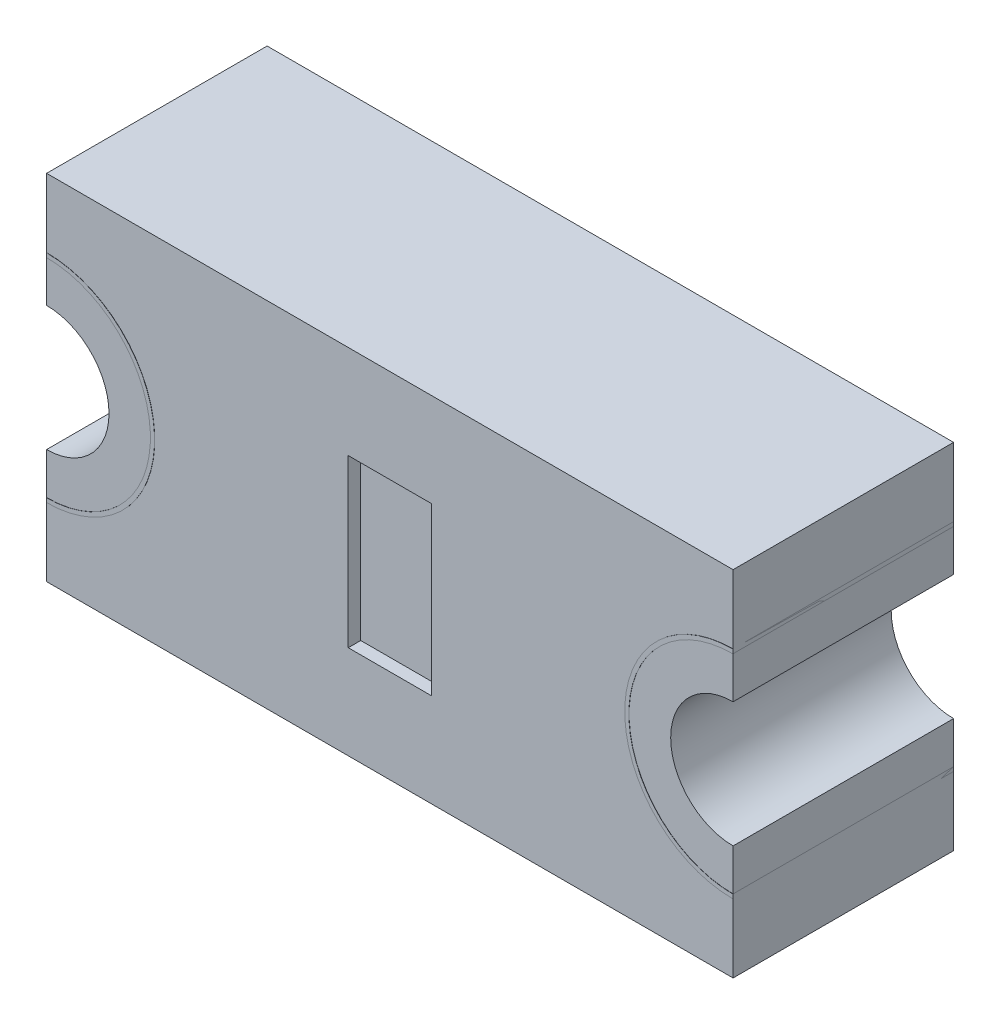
ISO-10303-21;
HEADER;
FILE_DESCRIPTION(('STEP AP214'),'2;1');
FILE_NAME('part.step','',(''),(''),'','','');
FILE_SCHEMA(('AUTOMOTIVE_DESIGN { 1 0 10303 214 1 1 1 1 }'));
ENDSEC;
DATA;
#1=APPLICATION_CONTEXT('core data for automotive mechanical design processes');
#2=APPLICATION_PROTOCOL_DEFINITION('international standard','automotive_design',2000,#1);
#3=PRODUCT_CONTEXT('',#1,'mechanical');
#4=PRODUCT('Part','Part','',(#3));
#5=PRODUCT_RELATED_PRODUCT_CATEGORY('part','',(#4));
#6=PRODUCT_DEFINITION_FORMATION('','',#4);
#7=PRODUCT_DEFINITION_CONTEXT('part definition',#1,'design');
#8=PRODUCT_DEFINITION('design','',#6,#7);
#9=PRODUCT_DEFINITION_SHAPE('','',#8);
#10=(LENGTH_UNIT() NAMED_UNIT(*) SI_UNIT(.MILLI.,.METRE.));
#11=(NAMED_UNIT(*) PLANE_ANGLE_UNIT() SI_UNIT($,.RADIAN.));
#12=(NAMED_UNIT(*) SI_UNIT($,.STERADIAN.) SOLID_ANGLE_UNIT());
#13=UNCERTAINTY_MEASURE_WITH_UNIT(LENGTH_MEASURE(1.E-05),#10,'distance_accuracy_value','');
#14=(GEOMETRIC_REPRESENTATION_CONTEXT(3) GLOBAL_UNCERTAINTY_ASSIGNED_CONTEXT((#13)) GLOBAL_UNIT_ASSIGNED_CONTEXT((#10,
#11,#12)) REPRESENTATION_CONTEXT('',''));
#15=CARTESIAN_POINT('',(0.,0.,0.));
#16=DIRECTION('',(0.,0.,1.));
#17=DIRECTION('',(1.,0.,0.));
#18=AXIS2_PLACEMENT_3D('',#15,#16,#17);
#19=CARTESIAN_POINT('',(-0.825,0.,1.5));
#20=DIRECTION('',(0.,0.,-1.));
#21=DIRECTION('',(-1.,0.,0.));
#22=AXIS2_PLACEMENT_3D('',#19,#20,#21);
#23=CYLINDRICAL_SURFACE('',#22,0.25);
#24=CARTESIAN_POINT('',(-0.825,0.,0.));
#25=DIRECTION('',(0.,0.,-1.));
#26=DIRECTION('',(1.,0.,0.));
#27=AXIS2_PLACEMENT_3D('',#24,#25,#26);
#28=CIRCLE('',#27,0.25);
#29=CARTESIAN_POINT('',(-0.825,0.25,0.));
#30=VERTEX_POINT('',#29);
#31=CARTESIAN_POINT('',(-0.825,-0.25,0.));
#32=VERTEX_POINT('',#31);
#33=EDGE_CURVE('P0_E256',#30,#32,#28,.T.);
#34=ORIENTED_EDGE('',*,*,#33,.T.);
#35=DIRECTION('',(0.,0.,1.));
#36=VECTOR('',#35,1.);
#37=CARTESIAN_POINT('',(-0.825,-0.25,1.5));
#38=LINE('',#37,#36);
#39=CARTESIAN_POINT('',(-0.825,-0.25,0.53));
#40=VERTEX_POINT('',#39);
#41=EDGE_CURVE('P0_E162',#32,#40,#38,.T.);
#42=ORIENTED_EDGE('',*,*,#41,.T.);
#43=CARTESIAN_POINT('',(-0.825,0.,0.53));
#44=DIRECTION('',(0.,0.,1.));
#45=DIRECTION('',(-1.,0.,0.));
#46=AXIS2_PLACEMENT_3D('',#43,#44,#45);
#47=CIRCLE('',#46,0.25);
#48=CARTESIAN_POINT('',(-0.825,0.25,0.53));
#49=VERTEX_POINT('',#48);
#50=EDGE_CURVE('P0_E147',#40,#49,#47,.T.);
#51=ORIENTED_EDGE('',*,*,#50,.T.);
#52=DIRECTION('',(0.,0.,-1.));
#53=VECTOR('',#52,1.);
#54=CARTESIAN_POINT('',(-0.825,0.25,1.5));
#55=LINE('',#54,#53);
#56=EDGE_CURVE('P0_E189',#49,#30,#55,.T.);
#57=ORIENTED_EDGE('',*,*,#56,.T.);
#58=EDGE_LOOP('',(#34,#42,#51,#57));
#59=FACE_BOUND('',#58,.T.);
#60=ADVANCED_FACE('P0_F17',(#59),#23,.F.);
#61=CARTESIAN_POINT('',(-0.825,0.425,0.5));
#62=DIRECTION('',(0.,-1.,0.));
#63=DIRECTION('',(0.,0.,-1.));
#64=AXIS2_PLACEMENT_3D('',#61,#62,#63);
#65=PLANE('',#64);
#66=DIRECTION('',(-1.,0.,0.));
#67=VECTOR('',#66,1.);
#68=CARTESIAN_POINT('',(-0.825,0.425,0.));
#69=LINE('',#68,#67);
#70=CARTESIAN_POINT('',(0.825,0.425,0.));
#71=VERTEX_POINT('',#70);
#72=CARTESIAN_POINT('',(-0.825,0.425,0.));
#73=VERTEX_POINT('',#72);
#74=EDGE_CURVE('P0_E226',#71,#73,#69,.T.);
#75=ORIENTED_EDGE('',*,*,#74,.T.);
#76=DIRECTION('',(0.,0.,-1.));
#77=VECTOR('',#76,1.);
#78=CARTESIAN_POINT('',(-0.825,0.425,0.5));
#79=LINE('',#78,#77);
#80=CARTESIAN_POINT('',(-0.825,0.425,0.53));
#81=VERTEX_POINT('',#80);
#82=EDGE_CURVE('P0_E184',#81,#73,#79,.T.);
#83=ORIENTED_EDGE('',*,*,#82,.F.);
#84=DIRECTION('',(-1.,0.,0.));
#85=VECTOR('',#84,1.);
#86=CARTESIAN_POINT('',(0.825,0.425,0.53));
#87=LINE('',#86,#85);
#88=CARTESIAN_POINT('',(0.825,0.425,0.53));
#89=VERTEX_POINT('',#88);
#90=EDGE_CURVE('P0_E194',#89,#81,#87,.T.);
#91=ORIENTED_EDGE('',*,*,#90,.F.);
#92=DIRECTION('',(0.,0.,-1.));
#93=VECTOR('',#92,1.);
#94=CARTESIAN_POINT('',(0.825,0.425,0.5));
#95=LINE('',#94,#93);
#96=EDGE_CURVE('P0_E11',#89,#71,#95,.T.);
#97=ORIENTED_EDGE('',*,*,#96,.T.);
#98=EDGE_LOOP('',(#75,#83,#91,#97));
#99=FACE_BOUND('',#98,.T.);
#100=ADVANCED_FACE('P0_F445',(#99),#65,.F.);
#101=CARTESIAN_POINT('',(0.825,0.425,0.5));
#102=DIRECTION('',(-1.,0.,0.));
#103=DIRECTION('',(0.,1.,0.));
#104=AXIS2_PLACEMENT_3D('',#101,#102,#103);
#105=PLANE('',#104);
#106=DIRECTION('',(0.,1.,0.));
#107=VECTOR('',#106,1.);
#108=CARTESIAN_POINT('',(0.825,0.425,0.53));
#109=LINE('',#108,#107);
#110=CARTESIAN_POINT('',(0.825,0.25,0.53));
#111=VERTEX_POINT('',#110);
#112=EDGE_CURVE('P0_E190',#111,#89,#109,.T.);
#113=ORIENTED_EDGE('',*,*,#112,.F.);
#114=DIRECTION('',(0.,0.,-1.));
#115=VECTOR('',#114,1.);
#116=CARTESIAN_POINT('',(0.825,0.25,1.5));
#117=LINE('',#116,#115);
#118=CARTESIAN_POINT('',(0.825,0.25,0.));
#119=VERTEX_POINT('',#118);
#120=EDGE_CURVE('P0_E25',#111,#119,#117,.T.);
#121=ORIENTED_EDGE('',*,*,#120,.T.);
#122=DIRECTION('',(0.,1.,0.));
#123=VECTOR('',#122,1.);
#124=CARTESIAN_POINT('',(0.825,0.425,0.));
#125=LINE('',#124,#123);
#126=EDGE_CURVE('P0_E222',#119,#71,#125,.T.);
#127=ORIENTED_EDGE('',*,*,#126,.T.);
#128=ORIENTED_EDGE('',*,*,#96,.F.);
#129=EDGE_LOOP('',(#113,#121,#127,#128));
#130=FACE_BOUND('',#129,.T.);
#131=ADVANCED_FACE('P0_F441',(#130),#105,.F.);
#132=CARTESIAN_POINT('',(0.825,0.,1.5));
#133=DIRECTION('',(0.,0.,-1.));
#134=DIRECTION('',(1.,0.,0.));
#135=AXIS2_PLACEMENT_3D('',#132,#133,#134);
#136=CYLINDRICAL_SURFACE('',#135,0.25);
#137=ORIENTED_EDGE('',*,*,#120,.F.);
#138=CARTESIAN_POINT('',(0.825,0.,0.53));
#139=DIRECTION('',(0.,0.,-1.));
#140=DIRECTION('',(-1.,0.,0.));
#141=AXIS2_PLACEMENT_3D('',#138,#139,#140);
#142=CIRCLE('',#141,0.25);
#143=CARTESIAN_POINT('',(0.825,-0.25,0.53));
#144=VERTEX_POINT('',#143);
#145=EDGE_CURVE('P0_E183',#144,#111,#142,.T.);
#146=ORIENTED_EDGE('',*,*,#145,.F.);
#147=DIRECTION('',(0.,0.,1.));
#148=VECTOR('',#147,1.);
#149=CARTESIAN_POINT('',(0.825,-0.25,1.5));
#150=LINE('',#149,#148);
#151=CARTESIAN_POINT('',(0.825,-0.25,0.));
#152=VERTEX_POINT('',#151);
#153=EDGE_CURVE('P0_E38',#152,#144,#150,.T.);
#154=ORIENTED_EDGE('',*,*,#153,.F.);
#155=CARTESIAN_POINT('',(0.825,0.,0.));
#156=DIRECTION('',(0.,0.,1.));
#157=DIRECTION('',(1.,0.,0.));
#158=AXIS2_PLACEMENT_3D('',#155,#156,#157);
#159=CIRCLE('',#158,0.25);
#160=EDGE_CURVE('P0_E225',#119,#152,#159,.T.);
#161=ORIENTED_EDGE('',*,*,#160,.F.);
#162=EDGE_LOOP('',(#137,#146,#154,#161));
#163=FACE_BOUND('',#162,.T.);
#164=ADVANCED_FACE('P0_F440',(#163),#136,.F.);
#165=CARTESIAN_POINT('',(0.825,0.425,0.5));
#166=DIRECTION('',(-1.,0.,0.));
#167=DIRECTION('',(0.,1.,0.));
#168=AXIS2_PLACEMENT_3D('',#165,#166,#167);
#169=PLANE('',#168);
#170=DIRECTION('',(0.,1.,0.));
#171=VECTOR('',#170,1.);
#172=CARTESIAN_POINT('',(0.825,0.425,0.));
#173=LINE('',#172,#171);
#174=CARTESIAN_POINT('',(0.825,-0.425,0.));
#175=VERTEX_POINT('',#174);
#176=EDGE_CURVE('P0_E264',#175,#152,#173,.T.);
#177=ORIENTED_EDGE('',*,*,#176,.T.);
#178=ORIENTED_EDGE('',*,*,#153,.T.);
#179=DIRECTION('',(0.,1.,0.));
#180=VECTOR('',#179,1.);
#181=CARTESIAN_POINT('',(0.825,0.425,0.53));
#182=LINE('',#181,#180);
#183=CARTESIAN_POINT('',(0.825,-0.425,0.53));
#184=VERTEX_POINT('',#183);
#185=EDGE_CURVE('P0_E180',#184,#144,#182,.T.);
#186=ORIENTED_EDGE('',*,*,#185,.F.);
#187=DIRECTION('',(0.,0.,-1.));
#188=VECTOR('',#187,1.);
#189=CARTESIAN_POINT('',(0.825,-0.425,0.5));
#190=LINE('',#189,#188);
#191=EDGE_CURVE('P0_E166',#184,#175,#190,.T.);
#192=ORIENTED_EDGE('',*,*,#191,.T.);
#193=EDGE_LOOP('',(#177,#178,#186,#192));
#194=FACE_BOUND('',#193,.T.);
#195=ADVANCED_FACE('P0_F439',(#194),#169,.F.);
#196=CARTESIAN_POINT('',(-0.825,-0.425,0.));
#197=DIRECTION('',(0.,0.,1.));
#198=DIRECTION('',(1.,0.,0.));
#199=AXIS2_PLACEMENT_3D('',#196,#197,#198);
#200=PLANE('',#199);
#201=ORIENTED_EDGE('',*,*,#33,.F.);
#202=DIRECTION('',(0.,-1.,0.));
#203=VECTOR('',#202,1.);
#204=CARTESIAN_POINT('',(-0.825,0.425,0.));
#205=LINE('',#204,#203);
#206=EDGE_CURVE('P0_E188',#73,#30,#205,.T.);
#207=ORIENTED_EDGE('',*,*,#206,.F.);
#208=ORIENTED_EDGE('',*,*,#74,.F.);
#209=ORIENTED_EDGE('',*,*,#126,.F.);
#210=ORIENTED_EDGE('',*,*,#160,.T.);
#211=ORIENTED_EDGE('',*,*,#176,.F.);
#212=DIRECTION('',(1.,0.,0.));
#213=VECTOR('',#212,1.);
#214=CARTESIAN_POINT('',(-0.825,-0.425,0.));
#215=LINE('',#214,#213);
#216=CARTESIAN_POINT('',(-0.825,-0.425,0.));
#217=VERTEX_POINT('',#216);
#218=EDGE_CURVE('P0_E173',#217,#175,#215,.T.);
#219=ORIENTED_EDGE('',*,*,#218,.F.);
#220=DIRECTION('',(0.,-1.,0.));
#221=VECTOR('',#220,1.);
#222=CARTESIAN_POINT('',(-0.825,0.425,0.));
#223=LINE('',#222,#221);
#224=EDGE_CURVE('P0_E152',#32,#217,#223,.T.);
#225=ORIENTED_EDGE('',*,*,#224,.F.);
#226=EDGE_LOOP('',(#201,#207,#208,#209,#210,#211,#219,#225));
#227=FACE_BOUND('',#226,.T.);
#228=ADVANCED_FACE('P0_F436',(#227),#200,.F.);
#229=CARTESIAN_POINT('',(-0.825,0.425,0.5));
#230=DIRECTION('',(1.,0.,0.));
#231=DIRECTION('',(0.,1.,0.));
#232=AXIS2_PLACEMENT_3D('',#229,#230,#231);
#233=PLANE('',#232);
#234=ORIENTED_EDGE('',*,*,#56,.F.);
#235=DIRECTION('',(0.,-1.,0.));
#236=VECTOR('',#235,1.);
#237=CARTESIAN_POINT('',(-0.825,0.425,0.53));
#238=LINE('',#237,#236);
#239=EDGE_CURVE('P0_E198',#81,#49,#238,.T.);
#240=ORIENTED_EDGE('',*,*,#239,.F.);
#241=ORIENTED_EDGE('',*,*,#82,.T.);
#242=ORIENTED_EDGE('',*,*,#206,.T.);
#243=EDGE_LOOP('',(#234,#240,#241,#242));
#244=FACE_BOUND('',#243,.T.);
#245=ADVANCED_FACE('P0_F450',(#244),#233,.F.);
#246=CARTESIAN_POINT('',(-0.825,-0.425,0.5));
#247=DIRECTION('',(0.,0.,1.));
#248=DIRECTION('',(1.,0.,0.));
#249=AXIS2_PLACEMENT_3D('',#246,#247,#248);
#250=PLANE('',#249);
#251=DIRECTION('',(0.,-1.,0.));
#252=VECTOR('',#251,1.);
#253=CARTESIAN_POINT('',(-0.1,0.2,0.5));
#254=LINE('',#253,#252);
#255=CARTESIAN_POINT('',(-0.1,0.2,0.5));
#256=VERTEX_POINT('',#255);
#257=CARTESIAN_POINT('',(-0.1,-0.2,0.5));
#258=VERTEX_POINT('',#257);
#259=EDGE_CURVE('P0_E250',#256,#258,#254,.T.);
#260=ORIENTED_EDGE('',*,*,#259,.T.);
#261=DIRECTION('',(1.,0.,0.));
#262=VECTOR('',#261,1.);
#263=CARTESIAN_POINT('',(-0.1,-0.2,0.5));
#264=LINE('',#263,#262);
#265=CARTESIAN_POINT('',(0.1,-0.2,0.5));
#266=VERTEX_POINT('',#265);
#267=EDGE_CURVE('P0_E217',#258,#266,#264,.T.);
#268=ORIENTED_EDGE('',*,*,#267,.T.);
#269=DIRECTION('',(0.,1.,0.));
#270=VECTOR('',#269,1.);
#271=CARTESIAN_POINT('',(0.1,0.2,0.5));
#272=LINE('',#271,#270);
#273=CARTESIAN_POINT('',(0.1,0.2,0.5));
#274=VERTEX_POINT('',#273);
#275=EDGE_CURVE('P0_E234',#266,#274,#272,.T.);
#276=ORIENTED_EDGE('',*,*,#275,.T.);
#277=DIRECTION('',(-1.,0.,0.));
#278=VECTOR('',#277,1.);
#279=CARTESIAN_POINT('',(-0.1,0.2,0.5));
#280=LINE('',#279,#278);
#281=EDGE_CURVE('P0_E242',#274,#256,#280,.T.);
#282=ORIENTED_EDGE('',*,*,#281,.T.);
#283=EDGE_LOOP('',(#260,#268,#276,#282));
#284=FACE_BOUND('',#283,.T.);
#285=ADVANCED_FACE('P0_F452',(#284),#250,.T.);
#286=CARTESIAN_POINT('',(-0.1,0.2,0.53));
#287=DIRECTION('',(1.,0.,0.));
#288=DIRECTION('',(0.,1.,0.));
#289=AXIS2_PLACEMENT_3D('',#286,#287,#288);
#290=PLANE('',#289);
#291=ORIENTED_EDGE('',*,*,#259,.F.);
#292=DIRECTION('',(0.,0.,-1.));
#293=VECTOR('',#292,1.);
#294=CARTESIAN_POINT('',(-0.1,0.2,0.53));
#295=LINE('',#294,#293);
#296=CARTESIAN_POINT('',(-0.1,0.2,0.53));
#297=VERTEX_POINT('',#296);
#298=EDGE_CURVE('P0_E246',#297,#256,#295,.T.);
#299=ORIENTED_EDGE('',*,*,#298,.F.);
#300=DIRECTION('',(0.,-1.,0.));
#301=VECTOR('',#300,1.);
#302=CARTESIAN_POINT('',(-0.1,0.2,0.53));
#303=LINE('',#302,#301);
#304=CARTESIAN_POINT('',(-0.1,-0.2,0.53));
#305=VERTEX_POINT('',#304);
#306=EDGE_CURVE('P0_E201',#297,#305,#303,.T.);
#307=ORIENTED_EDGE('',*,*,#306,.T.);
#308=DIRECTION('',(0.,0.,-1.));
#309=VECTOR('',#308,1.);
#310=CARTESIAN_POINT('',(-0.1,-0.2,0.53));
#311=LINE('',#310,#309);
#312=EDGE_CURVE('P0_E221',#305,#258,#311,.T.);
#313=ORIENTED_EDGE('',*,*,#312,.T.);
#314=EDGE_LOOP('',(#291,#299,#307,#313));
#315=FACE_BOUND('',#314,.T.);
#316=ADVANCED_FACE('P0_F459',(#315),#290,.T.);
#317=CARTESIAN_POINT('',(-0.1,0.2,0.53));
#318=DIRECTION('',(0.,-1.,0.));
#319=DIRECTION('',(0.,0.,-1.));
#320=AXIS2_PLACEMENT_3D('',#317,#318,#319);
#321=PLANE('',#320);
#322=ORIENTED_EDGE('',*,*,#281,.F.);
#323=DIRECTION('',(0.,0.,-1.));
#324=VECTOR('',#323,1.);
#325=CARTESIAN_POINT('',(0.1,0.2,0.53));
#326=LINE('',#325,#324);
#327=CARTESIAN_POINT('',(0.1,0.2,0.53));
#328=VERTEX_POINT('',#327);
#329=EDGE_CURVE('P0_E238',#328,#274,#326,.T.);
#330=ORIENTED_EDGE('',*,*,#329,.F.);
#331=DIRECTION('',(-1.,0.,0.));
#332=VECTOR('',#331,1.);
#333=CARTESIAN_POINT('',(-0.1,0.2,0.53));
#334=LINE('',#333,#332);
#335=EDGE_CURVE('P0_E205',#328,#297,#334,.T.);
#336=ORIENTED_EDGE('',*,*,#335,.T.);
#337=ORIENTED_EDGE('',*,*,#298,.T.);
#338=EDGE_LOOP('',(#322,#330,#336,#337));
#339=FACE_BOUND('',#338,.T.);
#340=ADVANCED_FACE('P0_F487',(#339),#321,.T.);
#341=CARTESIAN_POINT('',(0.1,0.2,0.53));
#342=DIRECTION('',(-1.,0.,0.));
#343=DIRECTION('',(0.,0.,1.));
#344=AXIS2_PLACEMENT_3D('',#341,#342,#343);
#345=PLANE('',#344);
#346=ORIENTED_EDGE('',*,*,#275,.F.);
#347=DIRECTION('',(0.,0.,-1.));
#348=VECTOR('',#347,1.);
#349=CARTESIAN_POINT('',(0.1,-0.2,0.53));
#350=LINE('',#349,#348);
#351=CARTESIAN_POINT('',(0.1,-0.2,0.53));
#352=VERTEX_POINT('',#351);
#353=EDGE_CURVE('P0_E230',#352,#266,#350,.T.);
#354=ORIENTED_EDGE('',*,*,#353,.F.);
#355=DIRECTION('',(0.,1.,0.));
#356=VECTOR('',#355,1.);
#357=CARTESIAN_POINT('',(0.1,0.2,0.53));
#358=LINE('',#357,#356);
#359=EDGE_CURVE('P0_E209',#352,#328,#358,.T.);
#360=ORIENTED_EDGE('',*,*,#359,.T.);
#361=ORIENTED_EDGE('',*,*,#329,.T.);
#362=EDGE_LOOP('',(#346,#354,#360,#361));
#363=FACE_BOUND('',#362,.T.);
#364=ADVANCED_FACE('P0_F489',(#363),#345,.T.);
#365=CARTESIAN_POINT('',(-0.1,-0.2,0.53));
#366=DIRECTION('',(0.,1.,0.));
#367=DIRECTION('',(1.,0.,0.));
#368=AXIS2_PLACEMENT_3D('',#365,#366,#367);
#369=PLANE('',#368);
#370=ORIENTED_EDGE('',*,*,#267,.F.);
#371=ORIENTED_EDGE('',*,*,#312,.F.);
#372=DIRECTION('',(1.,0.,0.));
#373=VECTOR('',#372,1.);
#374=CARTESIAN_POINT('',(-0.1,-0.2,0.53));
#375=LINE('',#374,#373);
#376=EDGE_CURVE('P0_E213',#305,#352,#375,.T.);
#377=ORIENTED_EDGE('',*,*,#376,.T.);
#378=ORIENTED_EDGE('',*,*,#353,.T.);
#379=EDGE_LOOP('',(#370,#371,#377,#378));
#380=FACE_BOUND('',#379,.T.);
#381=ADVANCED_FACE('P0_F483',(#380),#369,.T.);
#382=CARTESIAN_POINT('',(0.825,0.425,0.53));
#383=DIRECTION('',(0.,0.,-1.));
#384=DIRECTION('',(0.,-1.,0.));
#385=AXIS2_PLACEMENT_3D('',#382,#383,#384);
#386=PLANE('',#385);
#387=ORIENTED_EDGE('',*,*,#306,.F.);
#388=ORIENTED_EDGE('',*,*,#335,.F.);
#389=ORIENTED_EDGE('',*,*,#359,.F.);
#390=ORIENTED_EDGE('',*,*,#376,.F.);
#391=EDGE_LOOP('',(#387,#388,#389,#390));
#392=FACE_BOUND('',#391,.T.);
#393=ORIENTED_EDGE('',*,*,#50,.F.);
#394=DIRECTION('',(0.,-1.,0.));
#395=VECTOR('',#394,1.);
#396=CARTESIAN_POINT('',(-0.825,0.425,0.53));
#397=LINE('',#396,#395);
#398=CARTESIAN_POINT('',(-0.825,-0.425,0.53));
#399=VERTEX_POINT('',#398);
#400=EDGE_CURVE('P0_E138',#40,#399,#397,.T.);
#401=ORIENTED_EDGE('',*,*,#400,.T.);
#402=DIRECTION('',(1.,0.,0.));
#403=VECTOR('',#402,1.);
#404=CARTESIAN_POINT('',(0.825,-0.425,0.53));
#405=LINE('',#404,#403);
#406=EDGE_CURVE('P0_E143',#399,#184,#405,.T.);
#407=ORIENTED_EDGE('',*,*,#406,.T.);
#408=ORIENTED_EDGE('',*,*,#185,.T.);
#409=ORIENTED_EDGE('',*,*,#145,.T.);
#410=ORIENTED_EDGE('',*,*,#112,.T.);
#411=ORIENTED_EDGE('',*,*,#90,.T.);
#412=ORIENTED_EDGE('',*,*,#239,.T.);
#413=EDGE_LOOP('',(#393,#401,#407,#408,#409,#410,#411,#412));
#414=FACE_BOUND('',#413,.T.);
#415=ADVANCED_FACE('P0_F140',(#392,#414),#386,.F.);
#416=CARTESIAN_POINT('',(-0.825,0.425,0.5));
#417=DIRECTION('',(1.,0.,0.));
#418=DIRECTION('',(0.,1.,0.));
#419=AXIS2_PLACEMENT_3D('',#416,#417,#418);
#420=PLANE('',#419);
#421=ORIENTED_EDGE('',*,*,#41,.F.);
#422=ORIENTED_EDGE('',*,*,#224,.T.);
#423=DIRECTION('',(0.,0.,-1.));
#424=VECTOR('',#423,1.);
#425=CARTESIAN_POINT('',(-0.825,-0.425,0.5));
#426=LINE('',#425,#424);
#427=EDGE_CURVE('P0_E155',#399,#217,#426,.T.);
#428=ORIENTED_EDGE('',*,*,#427,.F.);
#429=ORIENTED_EDGE('',*,*,#400,.F.);
#430=EDGE_LOOP('',(#421,#422,#428,#429));
#431=FACE_BOUND('',#430,.T.);
#432=ADVANCED_FACE('P0_F156',(#431),#420,.F.);
#433=CARTESIAN_POINT('',(-0.825,-0.425,0.5));
#434=DIRECTION('',(0.,1.,0.));
#435=DIRECTION('',(1.,0.,0.));
#436=AXIS2_PLACEMENT_3D('',#433,#434,#435);
#437=PLANE('',#436);
#438=ORIENTED_EDGE('',*,*,#218,.T.);
#439=ORIENTED_EDGE('',*,*,#191,.F.);
#440=ORIENTED_EDGE('',*,*,#406,.F.);
#441=ORIENTED_EDGE('',*,*,#427,.T.);
#442=EDGE_LOOP('',(#438,#439,#440,#441));
#443=FACE_BOUND('',#442,.T.);
#444=ADVANCED_FACE('P0_F164',(#443),#437,.F.);
#445=CLOSED_SHELL('',(#60,#100,#131,#164,#195,#228,#245,#285,#316,#340,#364,#381,#415,#432,#444));
#446=MANIFOLD_SOLID_BREP('P0_B1',#445);
#447=CARTESIAN_POINT('',(0.825,0.,0.53));
#448=DIRECTION('',(0.,0.,1.));
#449=DIRECTION('',(1.,0.,0.));
#450=AXIS2_PLACEMENT_3D('',#447,#448,#449);
#451=PLANE('',#450);
#452=CARTESIAN_POINT('',(0.825,0.,0.53));
#453=DIRECTION('',(0.,0.,1.));
#454=DIRECTION('',(1.,0.,0.));
#455=AXIS2_PLACEMENT_3D('',#452,#453,#454);
#456=CIRCLE('',#455,0.25);
#457=CARTESIAN_POINT('',(0.825,0.25,0.53));
#458=VERTEX_POINT('',#457);
#459=CARTESIAN_POINT('',(0.825,-0.25,0.53));
#460=VERTEX_POINT('',#459);
#461=EDGE_CURVE('P1_E74',#458,#460,#456,.T.);
#462=ORIENTED_EDGE('',*,*,#461,.T.);
#463=DIRECTION('',(0.,1.,0.));
#464=VECTOR('',#463,1.);
#465=CARTESIAN_POINT('',(0.825,-0.15,0.53));
#466=LINE('',#465,#464);
#467=CARTESIAN_POINT('',(0.825,-0.15,0.53));
#468=VERTEX_POINT('',#467);
#469=EDGE_CURVE('P1_E97',#460,#468,#466,.T.);
#470=ORIENTED_EDGE('',*,*,#469,.T.);
#471=CARTESIAN_POINT('',(0.825,0.,0.53));
#472=DIRECTION('',(0.,0.,-1.));
#473=DIRECTION('',(1.,0.,0.));
#474=AXIS2_PLACEMENT_3D('',#471,#472,#473);
#475=CIRCLE('',#474,0.15);
#476=CARTESIAN_POINT('',(0.825,0.15,0.53));
#477=VERTEX_POINT('',#476);
#478=EDGE_CURVE('P1_E75',#468,#477,#475,.T.);
#479=ORIENTED_EDGE('',*,*,#478,.T.);
#480=DIRECTION('',(0.,1.,0.));
#481=VECTOR('',#480,1.);
#482=CARTESIAN_POINT('',(0.825,0.25,0.53));
#483=LINE('',#482,#481);
#484=EDGE_CURVE('P1_E25',#477,#458,#483,.T.);
#485=ORIENTED_EDGE('',*,*,#484,.T.);
#486=EDGE_LOOP('',(#462,#470,#479,#485));
#487=FACE_BOUND('',#486,.T.);
#488=ADVANCED_FACE('P1_F17',(#487),#451,.T.);
#489=CARTESIAN_POINT('',(0.825,0.,0.));
#490=DIRECTION('',(0.,0.,1.));
#491=DIRECTION('',(1.,0.,0.));
#492=AXIS2_PLACEMENT_3D('',#489,#490,#491);
#493=PLANE('',#492);
#494=CARTESIAN_POINT('',(0.825,0.,0.));
#495=DIRECTION('',(0.,0.,1.));
#496=DIRECTION('',(1.,0.,0.));
#497=AXIS2_PLACEMENT_3D('',#494,#495,#496);
#498=CIRCLE('',#497,0.25);
#499=CARTESIAN_POINT('',(0.825,0.25,0.));
#500=VERTEX_POINT('',#499);
#501=CARTESIAN_POINT('',(0.825,-0.25,0.));
#502=VERTEX_POINT('',#501);
#503=EDGE_CURVE('P1_E84',#500,#502,#498,.T.);
#504=ORIENTED_EDGE('',*,*,#503,.F.);
#505=DIRECTION('',(0.,1.,0.));
#506=VECTOR('',#505,1.);
#507=CARTESIAN_POINT('',(0.825,0.25,0.));
#508=LINE('',#507,#506);
#509=CARTESIAN_POINT('',(0.825,0.15,0.));
#510=VERTEX_POINT('',#509);
#511=EDGE_CURVE('P1_E11',#510,#500,#508,.T.);
#512=ORIENTED_EDGE('',*,*,#511,.F.);
#513=CARTESIAN_POINT('',(0.825,0.,0.));
#514=DIRECTION('',(0.,0.,-1.));
#515=DIRECTION('',(1.,0.,0.));
#516=AXIS2_PLACEMENT_3D('',#513,#514,#515);
#517=CIRCLE('',#516,0.15);
#518=CARTESIAN_POINT('',(0.825,-0.15,0.));
#519=VERTEX_POINT('',#518);
#520=EDGE_CURVE('P1_E100',#519,#510,#517,.T.);
#521=ORIENTED_EDGE('',*,*,#520,.F.);
#522=DIRECTION('',(0.,1.,0.));
#523=VECTOR('',#522,1.);
#524=CARTESIAN_POINT('',(0.825,-0.15,0.));
#525=LINE('',#524,#523);
#526=EDGE_CURVE('P1_E101',#502,#519,#525,.T.);
#527=ORIENTED_EDGE('',*,*,#526,.F.);
#528=EDGE_LOOP('',(#504,#512,#521,#527));
#529=FACE_BOUND('',#528,.T.);
#530=ADVANCED_FACE('P1_F122',(#529),#493,.F.);
#531=CARTESIAN_POINT('',(0.825,0.25,0.));
#532=DIRECTION('',(1.,0.,0.));
#533=DIRECTION('',(0.,1.,0.));
#534=AXIS2_PLACEMENT_3D('',#531,#532,#533);
#535=PLANE('',#534);
#536=ORIENTED_EDGE('',*,*,#484,.F.);
#537=DIRECTION('',(0.,0.,1.));
#538=VECTOR('',#537,1.);
#539=CARTESIAN_POINT('',(0.825,0.15,0.));
#540=LINE('',#539,#538);
#541=EDGE_CURVE('P1_E77',#510,#477,#540,.T.);
#542=ORIENTED_EDGE('',*,*,#541,.F.);
#543=ORIENTED_EDGE('',*,*,#511,.T.);
#544=DIRECTION('',(0.,0.,1.));
#545=VECTOR('',#544,1.);
#546=CARTESIAN_POINT('',(0.825,0.25,0.));
#547=LINE('',#546,#545);
#548=EDGE_CURVE('P1_E79',#500,#458,#547,.T.);
#549=ORIENTED_EDGE('',*,*,#548,.T.);
#550=EDGE_LOOP('',(#536,#542,#543,#549));
#551=FACE_BOUND('',#550,.T.);
#552=ADVANCED_FACE('P1_F80',(#551),#535,.T.);
#553=CARTESIAN_POINT('',(0.825,0.,0.));
#554=DIRECTION('',(0.,0.,1.));
#555=DIRECTION('',(1.,0.,0.));
#556=AXIS2_PLACEMENT_3D('',#553,#554,#555);
#557=CYLINDRICAL_SURFACE('',#556,0.15);
#558=ORIENTED_EDGE('',*,*,#478,.F.);
#559=DIRECTION('',(0.,0.,1.));
#560=VECTOR('',#559,1.);
#561=CARTESIAN_POINT('',(0.825,-0.15,0.));
#562=LINE('',#561,#560);
#563=EDGE_CURVE('P1_E104',#519,#468,#562,.T.);
#564=ORIENTED_EDGE('',*,*,#563,.F.);
#565=ORIENTED_EDGE('',*,*,#520,.T.);
#566=ORIENTED_EDGE('',*,*,#541,.T.);
#567=EDGE_LOOP('',(#558,#564,#565,#566));
#568=FACE_BOUND('',#567,.T.);
#569=ADVANCED_FACE('P1_F121',(#568),#557,.F.);
#570=CARTESIAN_POINT('',(0.825,-0.15,0.));
#571=DIRECTION('',(1.,0.,0.));
#572=DIRECTION('',(0.,1.,0.));
#573=AXIS2_PLACEMENT_3D('',#570,#571,#572);
#574=PLANE('',#573);
#575=ORIENTED_EDGE('',*,*,#469,.F.);
#576=DIRECTION('',(0.,0.,1.));
#577=VECTOR('',#576,1.);
#578=CARTESIAN_POINT('',(0.825,-0.25,0.));
#579=LINE('',#578,#577);
#580=EDGE_CURVE('P1_E89',#502,#460,#579,.T.);
#581=ORIENTED_EDGE('',*,*,#580,.F.);
#582=ORIENTED_EDGE('',*,*,#526,.T.);
#583=ORIENTED_EDGE('',*,*,#563,.T.);
#584=EDGE_LOOP('',(#575,#581,#582,#583));
#585=FACE_BOUND('',#584,.T.);
#586=ADVANCED_FACE('P1_F124',(#585),#574,.T.);
#587=CARTESIAN_POINT('',(0.825,0.,0.));
#588=DIRECTION('',(0.,0.,1.));
#589=DIRECTION('',(1.,0.,0.));
#590=AXIS2_PLACEMENT_3D('',#587,#588,#589);
#591=CYLINDRICAL_SURFACE('',#590,0.25);
#592=ORIENTED_EDGE('',*,*,#461,.F.);
#593=ORIENTED_EDGE('',*,*,#548,.F.);
#594=ORIENTED_EDGE('',*,*,#503,.T.);
#595=ORIENTED_EDGE('',*,*,#580,.T.);
#596=EDGE_LOOP('',(#592,#593,#594,#595));
#597=FACE_BOUND('',#596,.T.);
#598=ADVANCED_FACE('P1_F87',(#597),#591,.T.);
#599=CLOSED_SHELL('',(#488,#530,#552,#569,#586,#598));
#600=MANIFOLD_SOLID_BREP('P1_B1',#599);
#601=CARTESIAN_POINT('',(-0.825,-0.15,0.));
#602=DIRECTION('',(-1.,0.,0.));
#603=DIRECTION('',(0.,0.,1.));
#604=AXIS2_PLACEMENT_3D('',#601,#602,#603);
#605=PLANE('',#604);
#606=DIRECTION('',(0.,-1.,0.));
#607=VECTOR('',#606,1.);
#608=CARTESIAN_POINT('',(-0.825,-0.15,0.53));
#609=LINE('',#608,#607);
#610=CARTESIAN_POINT('',(-0.825,-0.15,0.53));
#611=VERTEX_POINT('',#610);
#612=CARTESIAN_POINT('',(-0.825,-0.25,0.53));
#613=VERTEX_POINT('',#612);
#614=EDGE_CURVE('P2_E110',#611,#613,#609,.T.);
#615=ORIENTED_EDGE('',*,*,#614,.F.);
#616=DIRECTION('',(0.,0.,1.));
#617=VECTOR('',#616,1.);
#618=CARTESIAN_POINT('',(-0.825,-0.15,0.));
#619=LINE('',#618,#617);
#620=CARTESIAN_POINT('',(-0.825,-0.15,0.));
#621=VERTEX_POINT('',#620);
#622=EDGE_CURVE('P2_E25',#621,#611,#619,.T.);
#623=ORIENTED_EDGE('',*,*,#622,.F.);
#624=DIRECTION('',(0.,-1.,0.));
#625=VECTOR('',#624,1.);
#626=CARTESIAN_POINT('',(-0.825,-0.15,0.));
#627=LINE('',#626,#625);
#628=CARTESIAN_POINT('',(-0.825,-0.25,0.));
#629=VERTEX_POINT('',#628);
#630=EDGE_CURVE('P2_E98',#621,#629,#627,.T.);
#631=ORIENTED_EDGE('',*,*,#630,.T.);
#632=DIRECTION('',(0.,0.,1.));
#633=VECTOR('',#632,1.);
#634=CARTESIAN_POINT('',(-0.825,-0.25,0.));
#635=LINE('',#634,#633);
#636=EDGE_CURVE('P2_E11',#629,#613,#635,.T.);
#637=ORIENTED_EDGE('',*,*,#636,.T.);
#638=EDGE_LOOP('',(#615,#623,#631,#637));
#639=FACE_BOUND('',#638,.T.);
#640=ADVANCED_FACE('P2_F17',(#639),#605,.T.);
#641=CARTESIAN_POINT('',(-0.825,0.,0.53));
#642=DIRECTION('',(0.,0.,-1.));
#643=DIRECTION('',(0.,-1.,0.));
#644=AXIS2_PLACEMENT_3D('',#641,#642,#643);
#645=PLANE('',#644);
#646=ORIENTED_EDGE('',*,*,#614,.T.);
#647=CARTESIAN_POINT('',(-0.825,0.,0.53));
#648=DIRECTION('',(0.,0.,1.));
#649=DIRECTION('',(-1.,0.,0.));
#650=AXIS2_PLACEMENT_3D('',#647,#648,#649);
#651=CIRCLE('',#650,0.25);
#652=CARTESIAN_POINT('',(-0.825,0.25,0.53));
#653=VERTEX_POINT('',#652);
#654=EDGE_CURVE('P2_E51',#613,#653,#651,.T.);
#655=ORIENTED_EDGE('',*,*,#654,.T.);
#656=DIRECTION('',(0.,-1.,0.));
#657=VECTOR('',#656,1.);
#658=CARTESIAN_POINT('',(-0.825,0.25,0.53));
#659=LINE('',#658,#657);
#660=CARTESIAN_POINT('',(-0.825,0.15,0.53));
#661=VERTEX_POINT('',#660);
#662=EDGE_CURVE('P2_E93',#653,#661,#659,.T.);
#663=ORIENTED_EDGE('',*,*,#662,.T.);
#664=CARTESIAN_POINT('',(-0.825,0.,0.53));
#665=DIRECTION('',(0.,0.,-1.));
#666=DIRECTION('',(-1.,0.,0.));
#667=AXIS2_PLACEMENT_3D('',#664,#665,#666);
#668=CIRCLE('',#667,0.15);
#669=EDGE_CURVE('P2_E38',#661,#611,#668,.T.);
#670=ORIENTED_EDGE('',*,*,#669,.T.);
#671=EDGE_LOOP('',(#646,#655,#663,#670));
#672=FACE_BOUND('',#671,.T.);
#673=ADVANCED_FACE('P2_F124',(#672),#645,.F.);
#674=CARTESIAN_POINT('',(-0.825,0.,0.));
#675=DIRECTION('',(0.,0.,1.));
#676=DIRECTION('',(-0.707106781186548,-0.707106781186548,0.));
#677=AXIS2_PLACEMENT_3D('',#674,#675,#676);
#678=CYLINDRICAL_SURFACE('',#677,0.25);
#679=ORIENTED_EDGE('',*,*,#654,.F.);
#680=ORIENTED_EDGE('',*,*,#636,.F.);
#681=CARTESIAN_POINT('',(-0.825,0.,0.));
#682=DIRECTION('',(0.,0.,1.));
#683=DIRECTION('',(-1.,0.,0.));
#684=AXIS2_PLACEMENT_3D('',#681,#682,#683);
#685=CIRCLE('',#684,0.25);
#686=CARTESIAN_POINT('',(-0.825,0.25,0.));
#687=VERTEX_POINT('',#686);
#688=EDGE_CURVE('P2_E86',#629,#687,#685,.T.);
#689=ORIENTED_EDGE('',*,*,#688,.T.);
#690=DIRECTION('',(0.,0.,1.));
#691=VECTOR('',#690,1.);
#692=CARTESIAN_POINT('',(-0.825,0.25,0.));
#693=LINE('',#692,#691);
#694=EDGE_CURVE('P2_E81',#687,#653,#693,.T.);
#695=ORIENTED_EDGE('',*,*,#694,.T.);
#696=EDGE_LOOP('',(#679,#680,#689,#695));
#697=FACE_BOUND('',#696,.T.);
#698=ADVANCED_FACE('P2_F125',(#697),#678,.T.);
#699=CARTESIAN_POINT('',(-0.825,0.,0.));
#700=DIRECTION('',(0.,0.,-1.));
#701=DIRECTION('',(0.,-1.,0.));
#702=AXIS2_PLACEMENT_3D('',#699,#700,#701);
#703=PLANE('',#702);
#704=ORIENTED_EDGE('',*,*,#688,.F.);
#705=ORIENTED_EDGE('',*,*,#630,.F.);
#706=CARTESIAN_POINT('',(-0.825,0.,0.));
#707=DIRECTION('',(0.,0.,-1.));
#708=DIRECTION('',(-1.,0.,0.));
#709=AXIS2_PLACEMENT_3D('',#706,#707,#708);
#710=CIRCLE('',#709,0.15);
#711=CARTESIAN_POINT('',(-0.825,0.15,0.));
#712=VERTEX_POINT('',#711);
#713=EDGE_CURVE('P2_E90',#712,#621,#710,.T.);
#714=ORIENTED_EDGE('',*,*,#713,.F.);
#715=DIRECTION('',(0.,-1.,0.));
#716=VECTOR('',#715,1.);
#717=CARTESIAN_POINT('',(-0.825,0.25,0.));
#718=LINE('',#717,#716);
#719=EDGE_CURVE('P2_E76',#687,#712,#718,.T.);
#720=ORIENTED_EDGE('',*,*,#719,.F.);
#721=EDGE_LOOP('',(#704,#705,#714,#720));
#722=FACE_BOUND('',#721,.T.);
#723=ADVANCED_FACE('P2_F96',(#722),#703,.T.);
#724=CARTESIAN_POINT('',(-0.825,0.25,0.));
#725=DIRECTION('',(-1.,0.,0.));
#726=DIRECTION('',(0.,0.,1.));
#727=AXIS2_PLACEMENT_3D('',#724,#725,#726);
#728=PLANE('',#727);
#729=ORIENTED_EDGE('',*,*,#662,.F.);
#730=ORIENTED_EDGE('',*,*,#694,.F.);
#731=ORIENTED_EDGE('',*,*,#719,.T.);
#732=DIRECTION('',(0.,0.,1.));
#733=VECTOR('',#732,1.);
#734=CARTESIAN_POINT('',(-0.825,0.15,0.));
#735=LINE('',#734,#733);
#736=EDGE_CURVE('P2_E80',#712,#661,#735,.T.);
#737=ORIENTED_EDGE('',*,*,#736,.T.);
#738=EDGE_LOOP('',(#729,#730,#731,#737));
#739=FACE_BOUND('',#738,.T.);
#740=ADVANCED_FACE('P2_F79',(#739),#728,.T.);
#741=CARTESIAN_POINT('',(-0.825,0.,0.));
#742=DIRECTION('',(0.,0.,1.));
#743=DIRECTION('',(-0.707106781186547,-0.707106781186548,0.));
#744=AXIS2_PLACEMENT_3D('',#741,#742,#743);
#745=CYLINDRICAL_SURFACE('',#744,0.15);
#746=ORIENTED_EDGE('',*,*,#713,.T.);
#747=ORIENTED_EDGE('',*,*,#622,.T.);
#748=ORIENTED_EDGE('',*,*,#669,.F.);
#749=ORIENTED_EDGE('',*,*,#736,.F.);
#750=EDGE_LOOP('',(#746,#747,#748,#749));
#751=FACE_BOUND('',#750,.T.);
#752=ADVANCED_FACE('P2_F89',(#751),#745,.F.);
#753=CLOSED_SHELL('',(#640,#673,#698,#723,#740,#752));
#754=MANIFOLD_SOLID_BREP('P2_B1',#753);
#755=CARTESIAN_POINT('',(0.825,0.26,0.5305));
#756=DIRECTION('',(1.,0.,0.));
#757=DIRECTION('',(0.,1.,0.));
#758=AXIS2_PLACEMENT_3D('',#755,#756,#757);
#759=PLANE('',#758);
#760=DIRECTION('',(0.,-1.,0.));
#761=VECTOR('',#760,1.);
#762=CARTESIAN_POINT('',(0.825,0.26,0.));
#763=LINE('',#762,#761);
#764=CARTESIAN_POINT('',(0.825,0.26,0.));
#765=VERTEX_POINT('',#764);
#766=CARTESIAN_POINT('',(0.825,0.25,0.));
#767=VERTEX_POINT('',#766);
#768=EDGE_CURVE('P3_E82',#765,#767,#763,.T.);
#769=ORIENTED_EDGE('',*,*,#768,.F.);
#770=DIRECTION('',(0.,0.,-1.));
#771=VECTOR('',#770,1.);
#772=CARTESIAN_POINT('',(0.825,0.26,0.5305));
#773=LINE('',#772,#771);
#774=CARTESIAN_POINT('',(0.825,0.26,0.5305));
#775=VERTEX_POINT('',#774);
#776=EDGE_CURVE('P3_E27',#775,#765,#773,.T.);
#777=ORIENTED_EDGE('',*,*,#776,.F.);
#778=DIRECTION('',(0.,-1.,0.));
#779=VECTOR('',#778,1.);
#780=CARTESIAN_POINT('',(0.825,0.26,0.5305));
#781=LINE('',#780,#779);
#782=CARTESIAN_POINT('',(0.825,0.25,0.5305));
#783=VERTEX_POINT('',#782);
#784=EDGE_CURVE('P3_E80',#775,#783,#781,.T.);
#785=ORIENTED_EDGE('',*,*,#784,.T.);
#786=DIRECTION('',(0.,0.,-1.));
#787=VECTOR('',#786,1.);
#788=CARTESIAN_POINT('',(0.825,0.25,0.5305));
#789=LINE('',#788,#787);
#790=EDGE_CURVE('P3_E11',#783,#767,#789,.T.);
#791=ORIENTED_EDGE('',*,*,#790,.T.);
#792=EDGE_LOOP('',(#769,#777,#785,#791));
#793=FACE_BOUND('',#792,.T.);
#794=ADVANCED_FACE('P3_F17',(#793),#759,.T.);
#795=CARTESIAN_POINT('',(0.825,0.,0.));
#796=DIRECTION('',(0.,0.,1.));
#797=DIRECTION('',(1.,0.,0.));
#798=AXIS2_PLACEMENT_3D('',#795,#796,#797);
#799=PLANE('',#798);
#800=ORIENTED_EDGE('',*,*,#768,.T.);
#801=CARTESIAN_POINT('',(0.825,0.,0.));
#802=DIRECTION('',(0.,0.,1.));
#803=DIRECTION('',(1.,0.,0.));
#804=AXIS2_PLACEMENT_3D('',#801,#802,#803);
#805=CIRCLE('',#804,0.25);
#806=CARTESIAN_POINT('',(0.825,-0.25,0.));
#807=VERTEX_POINT('',#806);
#808=EDGE_CURVE('P3_E87',#767,#807,#805,.T.);
#809=ORIENTED_EDGE('',*,*,#808,.T.);
#810=DIRECTION('',(0.,-1.,0.));
#811=VECTOR('',#810,1.);
#812=CARTESIAN_POINT('',(0.825,-0.26,0.));
#813=LINE('',#812,#811);
#814=CARTESIAN_POINT('',(0.825,-0.26,0.));
#815=VERTEX_POINT('',#814);
#816=EDGE_CURVE('P3_E110',#807,#815,#813,.T.);
#817=ORIENTED_EDGE('',*,*,#816,.T.);
#818=CARTESIAN_POINT('',(0.825,0.,0.));
#819=DIRECTION('',(0.,0.,-1.));
#820=DIRECTION('',(1.,0.,0.));
#821=AXIS2_PLACEMENT_3D('',#818,#819,#820);
#822=CIRCLE('',#821,0.26);
#823=EDGE_CURVE('P3_E41',#815,#765,#822,.T.);
#824=ORIENTED_EDGE('',*,*,#823,.T.);
#825=EDGE_LOOP('',(#800,#809,#817,#824));
#826=FACE_BOUND('',#825,.T.);
#827=ADVANCED_FACE('P3_F190',(#826),#799,.F.);
#828=CARTESIAN_POINT('',(0.825,0.,0.5305));
#829=DIRECTION('',(0.,0.,-1.));
#830=DIRECTION('',(0.707106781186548,0.707106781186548,0.));
#831=AXIS2_PLACEMENT_3D('',#828,#829,#830);
#832=CYLINDRICAL_SURFACE('',#831,0.25);
#833=ORIENTED_EDGE('',*,*,#808,.F.);
#834=ORIENTED_EDGE('',*,*,#790,.F.);
#835=CARTESIAN_POINT('',(0.825,0.,0.5305));
#836=DIRECTION('',(0.,0.,1.));
#837=DIRECTION('',(1.,0.,0.));
#838=AXIS2_PLACEMENT_3D('',#835,#836,#837);
#839=CIRCLE('',#838,0.25);
#840=CARTESIAN_POINT('',(0.825,-0.25,0.5305));
#841=VERTEX_POINT('',#840);
#842=EDGE_CURVE('P3_E85',#783,#841,#839,.T.);
#843=ORIENTED_EDGE('',*,*,#842,.T.);
#844=DIRECTION('',(0.,0.,-1.));
#845=VECTOR('',#844,1.);
#846=CARTESIAN_POINT('',(0.825,-0.25,0.5305));
#847=LINE('',#846,#845);
#848=EDGE_CURVE('P3_E104',#841,#807,#847,.T.);
#849=ORIENTED_EDGE('',*,*,#848,.T.);
#850=EDGE_LOOP('',(#833,#834,#843,#849));
#851=FACE_BOUND('',#850,.T.);
#852=ADVANCED_FACE('P3_F19',(#851),#832,.F.);
#853=CARTESIAN_POINT('',(0.825,0.,0.5305));
#854=DIRECTION('',(0.,0.,1.));
#855=DIRECTION('',(1.,0.,0.));
#856=AXIS2_PLACEMENT_3D('',#853,#854,#855);
#857=PLANE('',#856);
#858=ORIENTED_EDGE('',*,*,#842,.F.);
#859=ORIENTED_EDGE('',*,*,#784,.F.);
#860=CARTESIAN_POINT('',(0.825,0.,0.5305));
#861=DIRECTION('',(0.,0.,-1.));
#862=DIRECTION('',(1.,0.,0.));
#863=AXIS2_PLACEMENT_3D('',#860,#861,#862);
#864=CIRCLE('',#863,0.26);
#865=CARTESIAN_POINT('',(0.825,-0.26,0.5305));
#866=VERTEX_POINT('',#865);
#867=EDGE_CURVE('P3_E67',#866,#775,#864,.T.);
#868=ORIENTED_EDGE('',*,*,#867,.F.);
#869=DIRECTION('',(0.,-1.,0.));
#870=VECTOR('',#869,1.);
#871=CARTESIAN_POINT('',(0.825,-0.26,0.5305));
#872=LINE('',#871,#870);
#873=EDGE_CURVE('P3_E98',#841,#866,#872,.T.);
#874=ORIENTED_EDGE('',*,*,#873,.F.);
#875=EDGE_LOOP('',(#858,#859,#868,#874));
#876=FACE_BOUND('',#875,.T.);
#877=ADVANCED_FACE('P3_F84',(#876),#857,.T.);
#878=CARTESIAN_POINT('',(0.825,-0.26,0.5305));
#879=DIRECTION('',(1.,0.,0.));
#880=DIRECTION('',(0.,1.,0.));
#881=AXIS2_PLACEMENT_3D('',#878,#879,#880);
#882=PLANE('',#881);
#883=ORIENTED_EDGE('',*,*,#816,.F.);
#884=ORIENTED_EDGE('',*,*,#848,.F.);
#885=ORIENTED_EDGE('',*,*,#873,.T.);
#886=DIRECTION('',(0.,0.,-1.));
#887=VECTOR('',#886,1.);
#888=CARTESIAN_POINT('',(0.825,-0.26,0.5305));
#889=LINE('',#888,#887);
#890=EDGE_CURVE('P3_E73',#866,#815,#889,.T.);
#891=ORIENTED_EDGE('',*,*,#890,.T.);
#892=EDGE_LOOP('',(#883,#884,#885,#891));
#893=FACE_BOUND('',#892,.T.);
#894=ADVANCED_FACE('P3_F200',(#893),#882,.T.);
#895=CARTESIAN_POINT('',(0.825,0.,0.5305));
#896=DIRECTION('',(0.,0.,-1.));
#897=DIRECTION('',(0.707106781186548,0.707106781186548,0.));
#898=AXIS2_PLACEMENT_3D('',#895,#896,#897);
#899=CYLINDRICAL_SURFACE('',#898,0.26);
#900=ORIENTED_EDGE('',*,*,#867,.T.);
#901=ORIENTED_EDGE('',*,*,#776,.T.);
#902=ORIENTED_EDGE('',*,*,#823,.F.);
#903=ORIENTED_EDGE('',*,*,#890,.F.);
#904=EDGE_LOOP('',(#900,#901,#902,#903));
#905=FACE_BOUND('',#904,.T.);
#906=ADVANCED_FACE('P3_F69',(#905),#899,.T.);
#907=CLOSED_SHELL('',(#794,#827,#852,#877,#894,#906));
#908=MANIFOLD_SOLID_BREP('P3_B1',#907);
#909=CARTESIAN_POINT('',(-0.825,0.,0.));
#910=DIRECTION('',(0.,0.,-1.));
#911=DIRECTION('',(0.,-1.,0.));
#912=AXIS2_PLACEMENT_3D('',#909,#910,#911);
#913=PLANE('',#912);
#914=CARTESIAN_POINT('',(-0.825,0.,0.));
#915=DIRECTION('',(0.,0.,1.));
#916=DIRECTION('',(-1.,0.,0.));
#917=AXIS2_PLACEMENT_3D('',#914,#915,#916);
#918=CIRCLE('',#917,0.25);
#919=CARTESIAN_POINT('',(-0.825,-0.25,0.));
#920=VERTEX_POINT('',#919);
#921=CARTESIAN_POINT('',(-0.825,0.25,0.));
#922=VERTEX_POINT('',#921);
#923=EDGE_CURVE('P4_E102',#920,#922,#918,.T.);
#924=ORIENTED_EDGE('',*,*,#923,.T.);
#925=DIRECTION('',(0.,1.,0.));
#926=VECTOR('',#925,1.);
#927=CARTESIAN_POINT('',(-0.825,0.26,0.));
#928=LINE('',#927,#926);
#929=CARTESIAN_POINT('',(-0.825,0.26,0.));
#930=VERTEX_POINT('',#929);
#931=EDGE_CURVE('P4_E83',#922,#930,#928,.T.);
#932=ORIENTED_EDGE('',*,*,#931,.T.);
#933=CARTESIAN_POINT('',(-0.825,0.,0.));
#934=DIRECTION('',(0.,0.,-1.));
#935=DIRECTION('',(-1.,0.,0.));
#936=AXIS2_PLACEMENT_3D('',#933,#934,#935);
#937=CIRCLE('',#936,0.26);
#938=CARTESIAN_POINT('',(-0.825,-0.26,0.));
#939=VERTEX_POINT('',#938);
#940=EDGE_CURVE('P4_E110',#930,#939,#937,.T.);
#941=ORIENTED_EDGE('',*,*,#940,.T.);
#942=DIRECTION('',(0.,1.,0.));
#943=VECTOR('',#942,1.);
#944=CARTESIAN_POINT('',(-0.825,-0.25,0.));
#945=LINE('',#944,#943);
#946=EDGE_CURVE('P4_E25',#939,#920,#945,.T.);
#947=ORIENTED_EDGE('',*,*,#946,.T.);
#948=EDGE_LOOP('',(#924,#932,#941,#947));
#949=FACE_BOUND('',#948,.T.);
#950=ADVANCED_FACE('P4_F17',(#949),#913,.T.);
#951=CARTESIAN_POINT('',(-0.825,0.,0.5305));
#952=DIRECTION('',(0.,0.,-1.));
#953=DIRECTION('',(0.,-1.,0.));
#954=AXIS2_PLACEMENT_3D('',#951,#952,#953);
#955=PLANE('',#954);
#956=CARTESIAN_POINT('',(-0.825,0.,0.5305));
#957=DIRECTION('',(0.,0.,1.));
#958=DIRECTION('',(-1.,0.,0.));
#959=AXIS2_PLACEMENT_3D('',#956,#957,#958);
#960=CIRCLE('',#959,0.25);
#961=CARTESIAN_POINT('',(-0.825,-0.25,0.5305));
#962=VERTEX_POINT('',#961);
#963=CARTESIAN_POINT('',(-0.825,0.25,0.5305));
#964=VERTEX_POINT('',#963);
#965=EDGE_CURVE('P4_E74',#962,#964,#960,.T.);
#966=ORIENTED_EDGE('',*,*,#965,.F.);
#967=DIRECTION('',(0.,1.,0.));
#968=VECTOR('',#967,1.);
#969=CARTESIAN_POINT('',(-0.825,-0.25,0.5305));
#970=LINE('',#969,#968);
#971=CARTESIAN_POINT('',(-0.825,-0.26,0.5305));
#972=VERTEX_POINT('',#971);
#973=EDGE_CURVE('P4_E11',#972,#962,#970,.T.);
#974=ORIENTED_EDGE('',*,*,#973,.F.);
#975=CARTESIAN_POINT('',(-0.825,0.,0.5305));
#976=DIRECTION('',(0.,0.,-1.));
#977=DIRECTION('',(-1.,0.,0.));
#978=AXIS2_PLACEMENT_3D('',#975,#976,#977);
#979=CIRCLE('',#978,0.26);
#980=CARTESIAN_POINT('',(-0.825,0.26,0.5305));
#981=VERTEX_POINT('',#980);
#982=EDGE_CURVE('P4_E77',#981,#972,#979,.T.);
#983=ORIENTED_EDGE('',*,*,#982,.F.);
#984=DIRECTION('',(0.,1.,0.));
#985=VECTOR('',#984,1.);
#986=CARTESIAN_POINT('',(-0.825,0.26,0.5305));
#987=LINE('',#986,#985);
#988=EDGE_CURVE('P4_E70',#964,#981,#987,.T.);
#989=ORIENTED_EDGE('',*,*,#988,.F.);
#990=EDGE_LOOP('',(#966,#974,#983,#989));
#991=FACE_BOUND('',#990,.T.);
#992=ADVANCED_FACE('P4_F72',(#991),#955,.F.);
#993=CARTESIAN_POINT('',(-0.825,-0.25,0.5305));
#994=DIRECTION('',(-1.,0.,0.));
#995=DIRECTION('',(0.,0.,1.));
#996=AXIS2_PLACEMENT_3D('',#993,#994,#995);
#997=PLANE('',#996);
#998=ORIENTED_EDGE('',*,*,#946,.F.);
#999=DIRECTION('',(0.,0.,-1.));
#1000=VECTOR('',#999,1.);
#1001=CARTESIAN_POINT('',(-0.825,-0.26,0.5305));
#1002=LINE('',#1001,#1000);
#1003=EDGE_CURVE('P4_E109',#972,#939,#1002,.T.);
#1004=ORIENTED_EDGE('',*,*,#1003,.F.);
#1005=ORIENTED_EDGE('',*,*,#973,.T.);
#1006=DIRECTION('',(0.,0.,-1.));
#1007=VECTOR('',#1006,1.);
#1008=CARTESIAN_POINT('',(-0.825,-0.25,0.5305));
#1009=LINE('',#1008,#1007);
#1010=EDGE_CURVE('P4_E95',#962,#920,#1009,.T.);
#1011=ORIENTED_EDGE('',*,*,#1010,.T.);
#1012=EDGE_LOOP('',(#998,#1004,#1005,#1011));
#1013=FACE_BOUND('',#1012,.T.);
#1014=ADVANCED_FACE('P4_F125',(#1013),#997,.T.);
#1015=CARTESIAN_POINT('',(-0.825,0.,0.5305));
#1016=DIRECTION('',(0.,0.,-1.));
#1017=DIRECTION('',(-1.,0.,0.));
#1018=AXIS2_PLACEMENT_3D('',#1015,#1016,#1017);
#1019=CYLINDRICAL_SURFACE('',#1018,0.26);
#1020=ORIENTED_EDGE('',*,*,#940,.F.);
#1021=DIRECTION('',(0.,0.,-1.));
#1022=VECTOR('',#1021,1.);
#1023=CARTESIAN_POINT('',(-0.825,0.26,0.5305));
#1024=LINE('',#1023,#1022);
#1025=EDGE_CURVE('P4_E82',#981,#930,#1024,.T.);
#1026=ORIENTED_EDGE('',*,*,#1025,.F.);
#1027=ORIENTED_EDGE('',*,*,#982,.T.);
#1028=ORIENTED_EDGE('',*,*,#1003,.T.);
#1029=EDGE_LOOP('',(#1020,#1026,#1027,#1028));
#1030=FACE_BOUND('',#1029,.T.);
#1031=ADVANCED_FACE('P4_F123',(#1030),#1019,.T.);
#1032=CARTESIAN_POINT('',(-0.825,0.26,0.5305));
#1033=DIRECTION('',(-1.,0.,0.));
#1034=DIRECTION('',(0.,1.,0.));
#1035=AXIS2_PLACEMENT_3D('',#1032,#1033,#1034);
#1036=PLANE('',#1035);
#1037=ORIENTED_EDGE('',*,*,#931,.F.);
#1038=DIRECTION('',(0.,0.,-1.));
#1039=VECTOR('',#1038,1.);
#1040=CARTESIAN_POINT('',(-0.825,0.25,0.5305));
#1041=LINE('',#1040,#1039);
#1042=EDGE_CURVE('P4_E86',#964,#922,#1041,.T.);
#1043=ORIENTED_EDGE('',*,*,#1042,.F.);
#1044=ORIENTED_EDGE('',*,*,#988,.T.);
#1045=ORIENTED_EDGE('',*,*,#1025,.T.);
#1046=EDGE_LOOP('',(#1037,#1043,#1044,#1045));
#1047=FACE_BOUND('',#1046,.T.);
#1048=ADVANCED_FACE('P4_F87',(#1047),#1036,.T.);
#1049=CARTESIAN_POINT('',(-0.825,0.,0.5305));
#1050=DIRECTION('',(0.,0.,-1.));
#1051=DIRECTION('',(-1.,0.,0.));
#1052=AXIS2_PLACEMENT_3D('',#1049,#1050,#1051);
#1053=CYLINDRICAL_SURFACE('',#1052,0.25);
#1054=ORIENTED_EDGE('',*,*,#923,.F.);
#1055=ORIENTED_EDGE('',*,*,#1010,.F.);
#1056=ORIENTED_EDGE('',*,*,#965,.T.);
#1057=ORIENTED_EDGE('',*,*,#1042,.T.);
#1058=EDGE_LOOP('',(#1054,#1055,#1056,#1057));
#1059=FACE_BOUND('',#1058,.T.);
#1060=ADVANCED_FACE('P4_F94',(#1059),#1053,.F.);
#1061=CLOSED_SHELL('',(#950,#992,#1014,#1031,#1048,#1060));
#1062=MANIFOLD_SOLID_BREP('P4_B1',#1061);
#1063=ADVANCED_BREP_SHAPE_REPRESENTATION('',(#18,#446,#600,#754,#908,#1062),#14);
#1064=SHAPE_DEFINITION_REPRESENTATION(#9,#1063);
ENDSEC;
END-ISO-10303-21;
